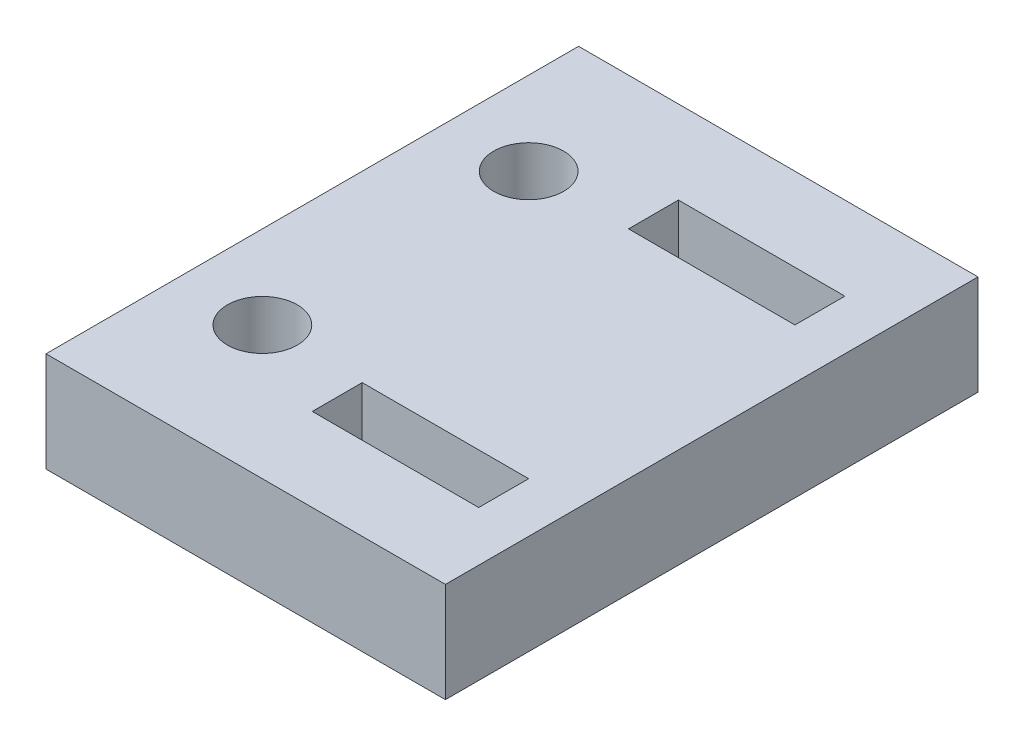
from build123d import *

# Parameters (mm, degrees)
SKETCH_1_W      = 24
SKETCH_1_H      = 32
SKETCH_1_R      = 2.1
SKETCH_1_W_2    = 10
SKETCH_1_H_2    = 3
EXTRUDE_1_DEPTH = 6


with BuildPart() as part:
    # Sketch 1 → Extrude 1 (new body)
    with BuildSketch(Plane(origin=(0, 0, 0), x_dir=(1, 0, 0), z_dir=(0, 1, 0))):
        with Locations((12, -16)):
            Rectangle(SKETCH_1_W, SKETCH_1_H)
        with Locations(Location((5, -8, 0), (0, 0, 270))):
            Circle(SKETCH_1_R, mode=Mode.SUBTRACT)
        with Locations(Location((5, -24, 0), (0, 0, 270))):
            Circle(SKETCH_1_R, mode=Mode.SUBTRACT)
        with Locations((16, -6.5)):
            Rectangle(SKETCH_1_W_2, SKETCH_1_H_2, mode=Mode.SUBTRACT)
        with Locations((16, -25.5)):
            Rectangle(SKETCH_1_W_2, SKETCH_1_H_2, mode=Mode.SUBTRACT)
    extrude(amount=EXTRUDE_1_DEPTH)


solid = part.part
